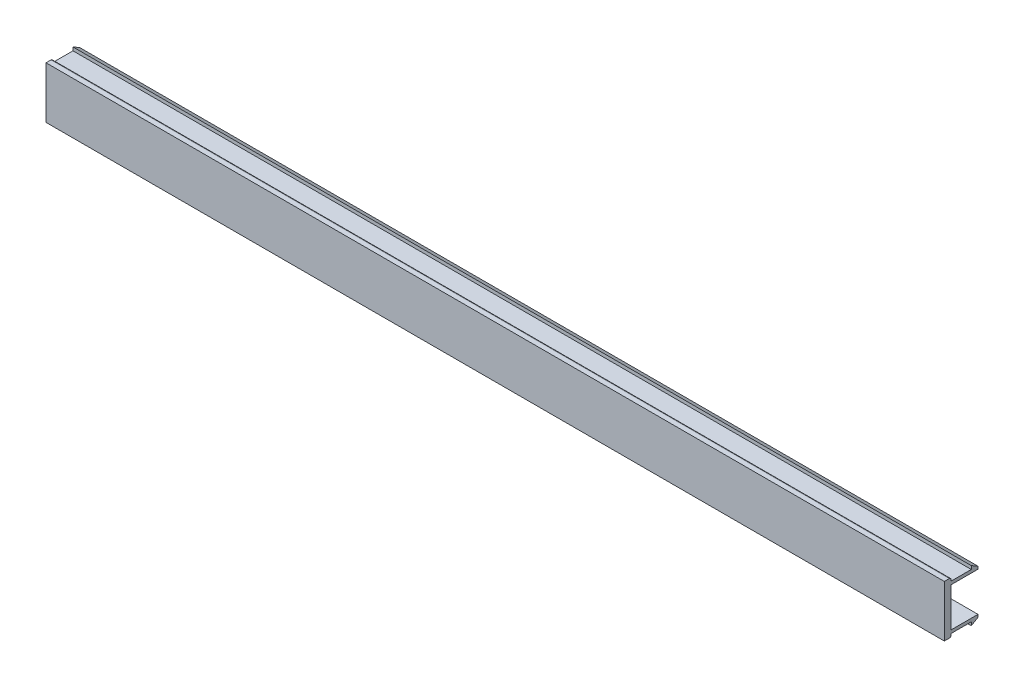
ISO-10303-21;
HEADER;
FILE_DESCRIPTION(('STEP AP214'),'2;1');
FILE_NAME('part.step','',(''),(''),'','','');
FILE_SCHEMA(('AUTOMOTIVE_DESIGN { 1 0 10303 214 1 1 1 1 }'));
ENDSEC;
DATA;
#1=APPLICATION_CONTEXT('core data for automotive mechanical design processes');
#2=APPLICATION_PROTOCOL_DEFINITION('international standard','automotive_design',2000,#1);
#3=PRODUCT_CONTEXT('',#1,'mechanical');
#4=PRODUCT('Part','Part','',(#3));
#5=PRODUCT_RELATED_PRODUCT_CATEGORY('part','',(#4));
#6=PRODUCT_DEFINITION_FORMATION('','',#4);
#7=PRODUCT_DEFINITION_CONTEXT('part definition',#1,'design');
#8=PRODUCT_DEFINITION('design','',#6,#7);
#9=PRODUCT_DEFINITION_SHAPE('','',#8);
#10=(LENGTH_UNIT() NAMED_UNIT(*) SI_UNIT(.MILLI.,.METRE.));
#11=(NAMED_UNIT(*) PLANE_ANGLE_UNIT() SI_UNIT($,.RADIAN.));
#12=(NAMED_UNIT(*) SI_UNIT($,.STERADIAN.) SOLID_ANGLE_UNIT());
#13=UNCERTAINTY_MEASURE_WITH_UNIT(LENGTH_MEASURE(1.E-05),#10,'distance_accuracy_value','');
#14=(GEOMETRIC_REPRESENTATION_CONTEXT(3) GLOBAL_UNCERTAINTY_ASSIGNED_CONTEXT((#13)) GLOBAL_UNIT_ASSIGNED_CONTEXT((#10,
#11,#12)) REPRESENTATION_CONTEXT('',''));
#15=CARTESIAN_POINT('',(0.,0.,0.));
#16=DIRECTION('',(0.,0.,1.));
#17=DIRECTION('',(1.,0.,0.));
#18=AXIS2_PLACEMENT_3D('',#15,#16,#17);
#19=CARTESIAN_POINT('',(0.,-5.366987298,-6.75));
#20=DIRECTION('',(0.,-0.866025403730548,-0.500000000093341));
#21=DIRECTION('',(0.,0.500000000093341,-0.866025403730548));
#22=AXIS2_PLACEMENT_3D('',#19,#20,#21);
#23=PLANE('',#22);
#24=DIRECTION('',(0.,0.500000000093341,-0.866025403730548));
#25=VECTOR('',#24,1.);
#26=CARTESIAN_POINT('',(0.,-5.366987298,-6.75));
#27=LINE('',#26,#25);
#28=CARTESIAN_POINT('',(0.,-5.8,-6.));
#29=VERTEX_POINT('',#28);
#30=CARTESIAN_POINT('',(0.,-4.933974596,-7.5));
#31=VERTEX_POINT('',#30);
#32=EDGE_CURVE('E304',#29,#31,#27,.T.);
#33=ORIENTED_EDGE('',*,*,#32,.T.);
#34=DIRECTION('',(-1.,0.,0.));
#35=VECTOR('',#34,1.);
#36=CARTESIAN_POINT('',(0.,-4.933974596,-7.5));
#37=LINE('',#36,#35);
#38=CARTESIAN_POINT('',(200.,-4.933974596,-7.5));
#39=VERTEX_POINT('',#38);
#40=EDGE_CURVE('E257',#39,#31,#37,.T.);
#41=ORIENTED_EDGE('',*,*,#40,.F.);
#42=DIRECTION('',(0.,0.500000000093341,-0.866025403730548));
#43=VECTOR('',#42,1.);
#44=CARTESIAN_POINT('',(200.,-5.366987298,-6.75));
#45=LINE('',#44,#43);
#46=CARTESIAN_POINT('',(200.,-5.8,-6.));
#47=VERTEX_POINT('',#46);
#48=EDGE_CURVE('E306',#39,#47,#45,.F.);
#49=ORIENTED_EDGE('',*,*,#48,.T.);
#50=DIRECTION('',(1.,0.,0.));
#51=VECTOR('',#50,1.);
#52=CARTESIAN_POINT('',(0.,-5.8,-6.));
#53=LINE('',#52,#51);
#54=EDGE_CURVE('E263',#29,#47,#53,.T.);
#55=ORIENTED_EDGE('',*,*,#54,.F.);
#56=EDGE_LOOP('',(#33,#41,#49,#55));
#57=FACE_BOUND('',#56,.T.);
#58=ADVANCED_FACE('F15',(#57),#23,.T.);
#59=CARTESIAN_POINT('',(0.,5.366987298,-6.75));
#60=DIRECTION('',(0.,0.866025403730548,-0.500000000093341));
#61=DIRECTION('',(0.,0.500000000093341,0.866025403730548));
#62=AXIS2_PLACEMENT_3D('',#59,#60,#61);
#63=PLANE('',#62);
#64=DIRECTION('',(0.,0.500000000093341,0.866025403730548));
#65=VECTOR('',#64,1.);
#66=CARTESIAN_POINT('',(0.,5.366987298,-6.75));
#67=LINE('',#66,#65);
#68=CARTESIAN_POINT('',(0.,4.933974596,-7.5));
#69=VERTEX_POINT('',#68);
#70=CARTESIAN_POINT('',(0.,5.8,-6.));
#71=VERTEX_POINT('',#70);
#72=EDGE_CURVE('E280',#69,#71,#67,.T.);
#73=ORIENTED_EDGE('',*,*,#72,.T.);
#74=DIRECTION('',(1.,0.,0.));
#75=VECTOR('',#74,1.);
#76=CARTESIAN_POINT('',(0.,5.8,-6.));
#77=LINE('',#76,#75);
#78=CARTESIAN_POINT('',(200.,5.8,-6.));
#79=VERTEX_POINT('',#78);
#80=EDGE_CURVE('E274',#79,#71,#77,.F.);
#81=ORIENTED_EDGE('',*,*,#80,.F.);
#82=DIRECTION('',(0.,0.500000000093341,0.866025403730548));
#83=VECTOR('',#82,1.);
#84=CARTESIAN_POINT('',(200.,5.366987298,-6.75));
#85=LINE('',#84,#83);
#86=CARTESIAN_POINT('',(200.,4.933974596,-7.5));
#87=VERTEX_POINT('',#86);
#88=EDGE_CURVE('E301',#79,#87,#85,.F.);
#89=ORIENTED_EDGE('',*,*,#88,.T.);
#90=DIRECTION('',(-1.,0.,0.));
#91=VECTOR('',#90,1.);
#92=CARTESIAN_POINT('',(0.,4.933974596,-7.5));
#93=LINE('',#92,#91);
#94=EDGE_CURVE('E247',#69,#87,#93,.F.);
#95=ORIENTED_EDGE('',*,*,#94,.F.);
#96=EDGE_LOOP('',(#73,#81,#89,#95));
#97=FACE_BOUND('',#96,.T.);
#98=ADVANCED_FACE('F511',(#97),#63,.T.);
#99=CARTESIAN_POINT('',(0.,5.425,-6.));
#100=DIRECTION('',(0.,0.,1.));
#101=DIRECTION('',(1.,0.,0.));
#102=AXIS2_PLACEMENT_3D('',#99,#100,#101);
#103=PLANE('',#102);
#104=DIRECTION('',(0.,1.,0.));
#105=VECTOR('',#104,1.);
#106=CARTESIAN_POINT('',(0.,5.425,-6.));
#107=LINE('',#106,#105);
#108=CARTESIAN_POINT('',(0.,5.05,-6.));
#109=VERTEX_POINT('',#108);
#110=EDGE_CURVE('E271',#71,#109,#107,.F.);
#111=ORIENTED_EDGE('',*,*,#110,.T.);
#112=DIRECTION('',(1.,0.,0.));
#113=VECTOR('',#112,1.);
#114=CARTESIAN_POINT('',(0.,5.05,-6.));
#115=LINE('',#114,#113);
#116=CARTESIAN_POINT('',(200.,5.05,-6.));
#117=VERTEX_POINT('',#116);
#118=EDGE_CURVE('E230',#117,#109,#115,.F.);
#119=ORIENTED_EDGE('',*,*,#118,.F.);
#120=DIRECTION('',(0.,1.,0.));
#121=VECTOR('',#120,1.);
#122=CARTESIAN_POINT('',(200.,5.425,-6.));
#123=LINE('',#122,#121);
#124=EDGE_CURVE('E277',#117,#79,#123,.T.);
#125=ORIENTED_EDGE('',*,*,#124,.T.);
#126=ORIENTED_EDGE('',*,*,#80,.T.);
#127=EDGE_LOOP('',(#111,#119,#125,#126));
#128=FACE_BOUND('',#127,.T.);
#129=ADVANCED_FACE('F503',(#128),#103,.T.);
#130=CARTESIAN_POINT('',(0.,5.2,-1.5));
#131=DIRECTION('',(0.,0.,-1.));
#132=DIRECTION('',(-1.,0.,0.));
#133=AXIS2_PLACEMENT_3D('',#130,#131,#132);
#134=PLANE('',#133);
#135=DIRECTION('',(0.,1.,0.));
#136=VECTOR('',#135,1.);
#137=CARTESIAN_POINT('',(0.,5.2,-1.5));
#138=LINE('',#137,#136);
#139=CARTESIAN_POINT('',(0.,5.05,-1.5));
#140=VERTEX_POINT('',#139);
#141=CARTESIAN_POINT('',(0.,5.35,-1.5));
#142=VERTEX_POINT('',#141);
#143=EDGE_CURVE('E112',#140,#142,#138,.T.);
#144=ORIENTED_EDGE('',*,*,#143,.T.);
#145=DIRECTION('',(1.,0.,0.));
#146=VECTOR('',#145,1.);
#147=CARTESIAN_POINT('',(0.,5.35,-1.5));
#148=LINE('',#147,#146);
#149=CARTESIAN_POINT('',(200.,5.35,-1.5));
#150=VERTEX_POINT('',#149);
#151=EDGE_CURVE('E238',#150,#142,#148,.F.);
#152=ORIENTED_EDGE('',*,*,#151,.F.);
#153=DIRECTION('',(0.,1.,0.));
#154=VECTOR('',#153,1.);
#155=CARTESIAN_POINT('',(200.,5.2,-1.5));
#156=LINE('',#155,#154);
#157=CARTESIAN_POINT('',(200.,5.05,-1.5));
#158=VERTEX_POINT('',#157);
#159=EDGE_CURVE('E273',#150,#158,#156,.F.);
#160=ORIENTED_EDGE('',*,*,#159,.T.);
#161=DIRECTION('',(1.,0.,0.));
#162=VECTOR('',#161,1.);
#163=CARTESIAN_POINT('',(0.,5.05,-1.5));
#164=LINE('',#163,#162);
#165=EDGE_CURVE('E233',#140,#158,#164,.T.);
#166=ORIENTED_EDGE('',*,*,#165,.F.);
#167=EDGE_LOOP('',(#144,#152,#160,#166));
#168=FACE_BOUND('',#167,.T.);
#169=ADVANCED_FACE('F495',(#168),#134,.T.);
#170=CARTESIAN_POINT('',(0.,-5.425,-6.));
#171=DIRECTION('',(0.,0.,1.));
#172=DIRECTION('',(1.,0.,0.));
#173=AXIS2_PLACEMENT_3D('',#170,#171,#172);
#174=PLANE('',#173);
#175=DIRECTION('',(0.,1.,0.));
#176=VECTOR('',#175,1.);
#177=CARTESIAN_POINT('',(0.,-5.425,-6.));
#178=LINE('',#177,#176);
#179=CARTESIAN_POINT('',(0.,-5.05,-6.));
#180=VERTEX_POINT('',#179);
#181=EDGE_CURVE('E266',#180,#29,#178,.F.);
#182=ORIENTED_EDGE('',*,*,#181,.T.);
#183=ORIENTED_EDGE('',*,*,#54,.T.);
#184=DIRECTION('',(0.,1.,0.));
#185=VECTOR('',#184,1.);
#186=CARTESIAN_POINT('',(200.,-5.425,-6.));
#187=LINE('',#186,#185);
#188=CARTESIAN_POINT('',(200.,-5.05,-6.));
#189=VERTEX_POINT('',#188);
#190=EDGE_CURVE('E269',#47,#189,#187,.T.);
#191=ORIENTED_EDGE('',*,*,#190,.T.);
#192=DIRECTION('',(1.,0.,0.));
#193=VECTOR('',#192,1.);
#194=CARTESIAN_POINT('',(0.,-5.05,-6.));
#195=LINE('',#194,#193);
#196=EDGE_CURVE('E217',#180,#189,#195,.T.);
#197=ORIENTED_EDGE('',*,*,#196,.F.);
#198=EDGE_LOOP('',(#182,#183,#191,#197));
#199=FACE_BOUND('',#198,.T.);
#200=ADVANCED_FACE('F354',(#199),#174,.T.);
#201=CARTESIAN_POINT('',(0.,-4.641987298,-7.5));
#202=DIRECTION('',(0.,0.,-1.));
#203=DIRECTION('',(-1.,0.,0.));
#204=AXIS2_PLACEMENT_3D('',#201,#202,#203);
#205=PLANE('',#204);
#206=DIRECTION('',(0.,1.,0.));
#207=VECTOR('',#206,1.);
#208=CARTESIAN_POINT('',(0.,-4.641987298,-7.5));
#209=LINE('',#208,#207);
#210=CARTESIAN_POINT('',(0.,-4.35,-7.5));
#211=VERTEX_POINT('',#210);
#212=EDGE_CURVE('E255',#31,#211,#209,.T.);
#213=ORIENTED_EDGE('',*,*,#212,.T.);
#214=DIRECTION('',(1.,0.,0.));
#215=VECTOR('',#214,1.);
#216=CARTESIAN_POINT('',(0.,-4.35,-7.5));
#217=LINE('',#216,#215);
#218=CARTESIAN_POINT('',(200.,-4.35,-7.5));
#219=VERTEX_POINT('',#218);
#220=EDGE_CURVE('E214',#219,#211,#217,.F.);
#221=ORIENTED_EDGE('',*,*,#220,.F.);
#222=DIRECTION('',(0.,1.,0.));
#223=VECTOR('',#222,1.);
#224=CARTESIAN_POINT('',(200.,-4.641987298,-7.5));
#225=LINE('',#224,#223);
#226=EDGE_CURVE('E260',#219,#39,#225,.F.);
#227=ORIENTED_EDGE('',*,*,#226,.T.);
#228=ORIENTED_EDGE('',*,*,#40,.T.);
#229=EDGE_LOOP('',(#213,#221,#227,#228));
#230=FACE_BOUND('',#229,.T.);
#231=ADVANCED_FACE('F361',(#230),#205,.T.);
#232=CARTESIAN_POINT('',(0.,4.641987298,-7.5));
#233=DIRECTION('',(0.,0.,-1.));
#234=DIRECTION('',(-1.,0.,0.));
#235=AXIS2_PLACEMENT_3D('',#232,#233,#234);
#236=PLANE('',#235);
#237=DIRECTION('',(0.,1.,0.));
#238=VECTOR('',#237,1.);
#239=CARTESIAN_POINT('',(0.,4.641987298,-7.5));
#240=LINE('',#239,#238);
#241=CARTESIAN_POINT('',(0.,4.35,-7.5));
#242=VERTEX_POINT('',#241);
#243=EDGE_CURVE('E167',#242,#69,#240,.T.);
#244=ORIENTED_EDGE('',*,*,#243,.T.);
#245=ORIENTED_EDGE('',*,*,#94,.T.);
#246=DIRECTION('',(0.,1.,0.));
#247=VECTOR('',#246,1.);
#248=CARTESIAN_POINT('',(200.,4.641987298,-7.5));
#249=LINE('',#248,#247);
#250=CARTESIAN_POINT('',(200.,4.35,-7.5));
#251=VERTEX_POINT('',#250);
#252=EDGE_CURVE('E253',#87,#251,#249,.F.);
#253=ORIENTED_EDGE('',*,*,#252,.T.);
#254=DIRECTION('',(1.,0.,0.));
#255=VECTOR('',#254,1.);
#256=CARTESIAN_POINT('',(0.,4.35,-7.5));
#257=LINE('',#256,#255);
#258=EDGE_CURVE('E163',#242,#251,#257,.T.);
#259=ORIENTED_EDGE('',*,*,#258,.F.);
#260=EDGE_LOOP('',(#244,#245,#253,#259));
#261=FACE_BOUND('',#260,.T.);
#262=ADVANCED_FACE('F472',(#261),#236,.T.);
#263=CARTESIAN_POINT('',(0.,-5.2,-1.5));
#264=DIRECTION('',(0.,0.,-1.));
#265=DIRECTION('',(-1.,0.,0.));
#266=AXIS2_PLACEMENT_3D('',#263,#264,#265);
#267=PLANE('',#266);
#268=DIRECTION('',(0.,1.,0.));
#269=VECTOR('',#268,1.);
#270=CARTESIAN_POINT('',(0.,-5.2,-1.5));
#271=LINE('',#270,#269);
#272=CARTESIAN_POINT('',(0.,-5.35,-1.5));
#273=VERTEX_POINT('',#272);
#274=CARTESIAN_POINT('',(0.,-5.05,-1.5));
#275=VERTEX_POINT('',#274);
#276=EDGE_CURVE('E241',#273,#275,#271,.T.);
#277=ORIENTED_EDGE('',*,*,#276,.T.);
#278=DIRECTION('',(1.,0.,0.));
#279=VECTOR('',#278,1.);
#280=CARTESIAN_POINT('',(0.,-5.05,-1.5));
#281=LINE('',#280,#279);
#282=CARTESIAN_POINT('',(200.,-5.05,-1.5));
#283=VERTEX_POINT('',#282);
#284=EDGE_CURVE('E220',#283,#275,#281,.F.);
#285=ORIENTED_EDGE('',*,*,#284,.F.);
#286=DIRECTION('',(0.,1.,0.));
#287=VECTOR('',#286,1.);
#288=CARTESIAN_POINT('',(200.,-5.2,-1.5));
#289=LINE('',#288,#287);
#290=CARTESIAN_POINT('',(200.,-5.35,-1.5));
#291=VERTEX_POINT('',#290);
#292=EDGE_CURVE('E243',#283,#291,#289,.F.);
#293=ORIENTED_EDGE('',*,*,#292,.T.);
#294=DIRECTION('',(1.,0.,0.));
#295=VECTOR('',#294,1.);
#296=CARTESIAN_POINT('',(0.,-5.35,-1.5));
#297=LINE('',#296,#295);
#298=EDGE_CURVE('E191',#273,#291,#297,.T.);
#299=ORIENTED_EDGE('',*,*,#298,.F.);
#300=EDGE_LOOP('',(#277,#285,#293,#299));
#301=FACE_BOUND('',#300,.T.);
#302=ADVANCED_FACE('F348',(#301),#267,.T.);
#303=CARTESIAN_POINT('',(0.,5.35,-1.1));
#304=DIRECTION('',(1.,0.,0.));
#305=DIRECTION('',(0.,0.,-1.));
#306=AXIS2_PLACEMENT_3D('',#303,#304,#305);
#307=CYLINDRICAL_SURFACE('',#306,0.400000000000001);
#308=CARTESIAN_POINT('',(0.,5.35,-1.1));
#309=DIRECTION('',(1.,0.,0.));
#310=DIRECTION('',(0.,0.,-1.));
#311=AXIS2_PLACEMENT_3D('',#308,#309,#310);
#312=CIRCLE('',#311,0.400000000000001);
#313=CARTESIAN_POINT('',(0.,5.75,-1.1));
#314=VERTEX_POINT('',#313);
#315=EDGE_CURVE('E18',#142,#314,#312,.T.);
#316=ORIENTED_EDGE('',*,*,#315,.T.);
#317=DIRECTION('',(1.,0.,0.));
#318=VECTOR('',#317,1.);
#319=CARTESIAN_POINT('',(0.,5.75,-1.1));
#320=LINE('',#319,#318);
#321=CARTESIAN_POINT('',(200.,5.75,-1.1));
#322=VERTEX_POINT('',#321);
#323=EDGE_CURVE('E223',#322,#314,#320,.F.);
#324=ORIENTED_EDGE('',*,*,#323,.F.);
#325=CARTESIAN_POINT('',(200.,5.35,-1.1));
#326=DIRECTION('',(1.,0.,0.));
#327=DIRECTION('',(0.,0.,-1.));
#328=AXIS2_PLACEMENT_3D('',#325,#326,#327);
#329=CIRCLE('',#328,0.400000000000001);
#330=EDGE_CURVE('E319',#150,#322,#329,.T.);
#331=ORIENTED_EDGE('',*,*,#330,.F.);
#332=ORIENTED_EDGE('',*,*,#151,.T.);
#333=EDGE_LOOP('',(#316,#324,#331,#332));
#334=FACE_BOUND('',#333,.T.);
#335=ADVANCED_FACE('F332',(#334),#307,.T.);
#336=CARTESIAN_POINT('',(0.,5.05,-3.75));
#337=DIRECTION('',(0.,1.,0.));
#338=DIRECTION('',(0.,0.,1.));
#339=AXIS2_PLACEMENT_3D('',#336,#337,#338);
#340=PLANE('',#339);
#341=DIRECTION('',(0.,0.,-1.));
#342=VECTOR('',#341,1.);
#343=CARTESIAN_POINT('',(0.,5.05,-2.83618380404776));
#344=LINE('',#343,#342);
#345=EDGE_CURVE('E179',#109,#140,#344,.F.);
#346=ORIENTED_EDGE('',*,*,#345,.T.);
#347=ORIENTED_EDGE('',*,*,#165,.T.);
#348=DIRECTION('',(0.,0.,-1.));
#349=VECTOR('',#348,1.);
#350=CARTESIAN_POINT('',(200.,5.05,-2.83618380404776));
#351=LINE('',#350,#349);
#352=EDGE_CURVE('E188',#117,#158,#351,.F.);
#353=ORIENTED_EDGE('',*,*,#352,.F.);
#354=ORIENTED_EDGE('',*,*,#118,.T.);
#355=EDGE_LOOP('',(#346,#347,#353,#354));
#356=FACE_BOUND('',#355,.T.);
#357=ADVANCED_FACE('F371',(#356),#340,.T.);
#358=CARTESIAN_POINT('',(0.,-5.05,-3.75));
#359=DIRECTION('',(0.,-1.,0.));
#360=DIRECTION('',(0.,0.,-1.));
#361=AXIS2_PLACEMENT_3D('',#358,#359,#360);
#362=PLANE('',#361);
#363=DIRECTION('',(0.,0.,-1.));
#364=VECTOR('',#363,1.);
#365=CARTESIAN_POINT('',(0.,-5.05,-2.83618380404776));
#366=LINE('',#365,#364);
#367=EDGE_CURVE('E175',#275,#180,#366,.T.);
#368=ORIENTED_EDGE('',*,*,#367,.T.);
#369=ORIENTED_EDGE('',*,*,#196,.T.);
#370=DIRECTION('',(0.,0.,-1.));
#371=VECTOR('',#370,1.);
#372=CARTESIAN_POINT('',(200.,-5.05,-2.83618380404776));
#373=LINE('',#372,#371);
#374=EDGE_CURVE('E186',#283,#189,#373,.T.);
#375=ORIENTED_EDGE('',*,*,#374,.F.);
#376=ORIENTED_EDGE('',*,*,#284,.T.);
#377=EDGE_LOOP('',(#368,#369,#375,#376));
#378=FACE_BOUND('',#377,.T.);
#379=ADVANCED_FACE('F351',(#378),#362,.T.);
#380=CARTESIAN_POINT('',(0.,-4.35,-4.5));
#381=DIRECTION('',(0.,1.,0.));
#382=DIRECTION('',(0.,0.,1.));
#383=AXIS2_PLACEMENT_3D('',#380,#381,#382);
#384=PLANE('',#383);
#385=DIRECTION('',(0.,0.,-1.));
#386=VECTOR('',#385,1.);
#387=CARTESIAN_POINT('',(0.,-4.35,-2.83618380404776));
#388=LINE('',#387,#386);
#389=CARTESIAN_POINT('',(0.,-4.35,-1.5));
#390=VERTEX_POINT('',#389);
#391=EDGE_CURVE('E154',#211,#390,#388,.F.);
#392=ORIENTED_EDGE('',*,*,#391,.T.);
#393=DIRECTION('',(-1.,0.,0.));
#394=VECTOR('',#393,1.);
#395=CARTESIAN_POINT('',(0.,-4.35,-1.5));
#396=LINE('',#395,#394);
#397=CARTESIAN_POINT('',(200.,-4.35,-1.5));
#398=VERTEX_POINT('',#397);
#399=EDGE_CURVE('E119',#398,#390,#396,.T.);
#400=ORIENTED_EDGE('',*,*,#399,.F.);
#401=DIRECTION('',(0.,0.,-1.));
#402=VECTOR('',#401,1.);
#403=CARTESIAN_POINT('',(200.,-4.35,-2.83618380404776));
#404=LINE('',#403,#402);
#405=EDGE_CURVE('E182',#219,#398,#404,.F.);
#406=ORIENTED_EDGE('',*,*,#405,.F.);
#407=ORIENTED_EDGE('',*,*,#220,.T.);
#408=EDGE_LOOP('',(#392,#400,#406,#407));
#409=FACE_BOUND('',#408,.T.);
#410=ADVANCED_FACE('F362',(#409),#384,.T.);
#411=CARTESIAN_POINT('',(0.,0.,-1.5));
#412=DIRECTION('',(0.,0.,-1.));
#413=DIRECTION('',(-1.,0.,0.));
#414=AXIS2_PLACEMENT_3D('',#411,#412,#413);
#415=PLANE('',#414);
#416=DIRECTION('',(0.,1.,0.));
#417=VECTOR('',#416,1.);
#418=CARTESIAN_POINT('',(0.,0.,-1.5));
#419=LINE('',#418,#417);
#420=CARTESIAN_POINT('',(0.,4.35,-1.5));
#421=VERTEX_POINT('',#420);
#422=EDGE_CURVE('E146',#390,#421,#419,.T.);
#423=ORIENTED_EDGE('',*,*,#422,.T.);
#424=DIRECTION('',(1.,0.,0.));
#425=VECTOR('',#424,1.);
#426=CARTESIAN_POINT('',(0.,4.35,-1.5));
#427=LINE('',#426,#425);
#428=CARTESIAN_POINT('',(200.,4.35,-1.5));
#429=VERTEX_POINT('',#428);
#430=EDGE_CURVE('E149',#429,#421,#427,.F.);
#431=ORIENTED_EDGE('',*,*,#430,.F.);
#432=DIRECTION('',(0.,1.,0.));
#433=VECTOR('',#432,1.);
#434=CARTESIAN_POINT('',(200.,0.,-1.5));
#435=LINE('',#434,#433);
#436=EDGE_CURVE('E189',#398,#429,#435,.T.);
#437=ORIENTED_EDGE('',*,*,#436,.F.);
#438=ORIENTED_EDGE('',*,*,#399,.T.);
#439=EDGE_LOOP('',(#423,#431,#437,#438));
#440=FACE_BOUND('',#439,.T.);
#441=ADVANCED_FACE('F148',(#440),#415,.T.);
#442=CARTESIAN_POINT('',(0.,4.35,-4.5));
#443=DIRECTION('',(0.,-1.,0.));
#444=DIRECTION('',(0.,0.,-1.));
#445=AXIS2_PLACEMENT_3D('',#442,#443,#444);
#446=PLANE('',#445);
#447=DIRECTION('',(0.,0.,-1.));
#448=VECTOR('',#447,1.);
#449=CARTESIAN_POINT('',(0.,4.35,-2.83618380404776));
#450=LINE('',#449,#448);
#451=EDGE_CURVE('E153',#421,#242,#450,.T.);
#452=ORIENTED_EDGE('',*,*,#451,.T.);
#453=ORIENTED_EDGE('',*,*,#258,.T.);
#454=DIRECTION('',(0.,0.,-1.));
#455=VECTOR('',#454,1.);
#456=CARTESIAN_POINT('',(200.,4.35,-2.83618380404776));
#457=LINE('',#456,#455);
#458=EDGE_CURVE('E161',#429,#251,#457,.T.);
#459=ORIENTED_EDGE('',*,*,#458,.F.);
#460=ORIENTED_EDGE('',*,*,#430,.T.);
#461=EDGE_LOOP('',(#452,#453,#459,#460));
#462=FACE_BOUND('',#461,.T.);
#463=ADVANCED_FACE('F158',(#462),#446,.T.);
#464=CARTESIAN_POINT('',(0.,-5.35,-1.1));
#465=DIRECTION('',(1.,0.,0.));
#466=DIRECTION('',(0.,0.,-1.));
#467=AXIS2_PLACEMENT_3D('',#464,#465,#466);
#468=CYLINDRICAL_SURFACE('',#467,0.400000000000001);
#469=CARTESIAN_POINT('',(0.,-5.35,-1.1));
#470=DIRECTION('',(1.,0.,0.));
#471=DIRECTION('',(0.,0.,-1.));
#472=AXIS2_PLACEMENT_3D('',#469,#470,#471);
#473=CIRCLE('',#472,0.400000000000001);
#474=CARTESIAN_POINT('',(0.,-5.75,-1.1));
#475=VERTEX_POINT('',#474);
#476=EDGE_CURVE('E178',#475,#273,#473,.T.);
#477=ORIENTED_EDGE('',*,*,#476,.T.);
#478=ORIENTED_EDGE('',*,*,#298,.T.);
#479=CARTESIAN_POINT('',(200.,-5.35,-1.1));
#480=DIRECTION('',(1.,0.,0.));
#481=DIRECTION('',(0.,0.,-1.));
#482=AXIS2_PLACEMENT_3D('',#479,#480,#481);
#483=CIRCLE('',#482,0.400000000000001);
#484=CARTESIAN_POINT('',(200.,-5.75,-1.1));
#485=VERTEX_POINT('',#484);
#486=EDGE_CURVE('E297',#485,#291,#483,.T.);
#487=ORIENTED_EDGE('',*,*,#486,.F.);
#488=DIRECTION('',(1.,0.,0.));
#489=VECTOR('',#488,1.);
#490=CARTESIAN_POINT('',(0.,-5.75,-1.1));
#491=LINE('',#490,#489);
#492=EDGE_CURVE('E192',#475,#485,#491,.T.);
#493=ORIENTED_EDGE('',*,*,#492,.F.);
#494=EDGE_LOOP('',(#477,#478,#487,#493));
#495=FACE_BOUND('',#494,.T.);
#496=ADVANCED_FACE('F343',(#495),#468,.T.);
#497=CARTESIAN_POINT('',(200.,0.,-2.83618380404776));
#498=DIRECTION('',(1.,0.,0.));
#499=DIRECTION('',(0.,0.,-1.));
#500=AXIS2_PLACEMENT_3D('',#497,#498,#499);
#501=PLANE('',#500);
#502=ORIENTED_EDGE('',*,*,#226,.F.);
#503=ORIENTED_EDGE('',*,*,#405,.T.);
#504=ORIENTED_EDGE('',*,*,#436,.T.);
#505=ORIENTED_EDGE('',*,*,#458,.T.);
#506=ORIENTED_EDGE('',*,*,#252,.F.);
#507=ORIENTED_EDGE('',*,*,#88,.F.);
#508=ORIENTED_EDGE('',*,*,#124,.F.);
#509=ORIENTED_EDGE('',*,*,#352,.T.);
#510=ORIENTED_EDGE('',*,*,#159,.F.);
#511=ORIENTED_EDGE('',*,*,#330,.T.);
#512=DIRECTION('',(0.,0.,1.));
#513=VECTOR('',#512,1.);
#514=CARTESIAN_POINT('',(200.,5.75,-0.55));
#515=LINE('',#514,#513);
#516=CARTESIAN_POINT('',(200.,5.75,0.));
#517=VERTEX_POINT('',#516);
#518=EDGE_CURVE('E185',#517,#322,#515,.F.);
#519=ORIENTED_EDGE('',*,*,#518,.F.);
#520=DIRECTION('',(0.,1.,0.));
#521=VECTOR('',#520,1.);
#522=CARTESIAN_POINT('',(200.,0.,0.));
#523=LINE('',#522,#521);
#524=CARTESIAN_POINT('',(200.,-5.75,0.));
#525=VERTEX_POINT('',#524);
#526=EDGE_CURVE('E195',#525,#517,#523,.T.);
#527=ORIENTED_EDGE('',*,*,#526,.F.);
#528=DIRECTION('',(0.,0.,-1.));
#529=VECTOR('',#528,1.);
#530=CARTESIAN_POINT('',(200.,-5.75,-0.55));
#531=LINE('',#530,#529);
#532=EDGE_CURVE('E169',#485,#525,#531,.F.);
#533=ORIENTED_EDGE('',*,*,#532,.F.);
#534=ORIENTED_EDGE('',*,*,#486,.T.);
#535=ORIENTED_EDGE('',*,*,#292,.F.);
#536=ORIENTED_EDGE('',*,*,#374,.T.);
#537=ORIENTED_EDGE('',*,*,#190,.F.);
#538=ORIENTED_EDGE('',*,*,#48,.F.);
#539=EDGE_LOOP('',(#502,#503,#504,#505,#506,#507,#508,#509,#510,#511,#519,#527,#533,#534,#535,
#536,#537,#538));
#540=FACE_BOUND('',#539,.T.);
#541=ADVANCED_FACE('F328',(#540),#501,.T.);
#542=CARTESIAN_POINT('',(0.,5.75,-0.55));
#543=DIRECTION('',(0.,1.,0.));
#544=DIRECTION('',(0.,0.,1.));
#545=AXIS2_PLACEMENT_3D('',#542,#543,#544);
#546=PLANE('',#545);
#547=DIRECTION('',(0.,0.,-1.));
#548=VECTOR('',#547,1.);
#549=CARTESIAN_POINT('',(0.,5.75,-2.83618380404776));
#550=LINE('',#549,#548);
#551=CARTESIAN_POINT('',(0.,5.75,0.));
#552=VERTEX_POINT('',#551);
#553=EDGE_CURVE('E176',#314,#552,#550,.F.);
#554=ORIENTED_EDGE('',*,*,#553,.T.);
#555=DIRECTION('',(1.,0.,0.));
#556=VECTOR('',#555,1.);
#557=CARTESIAN_POINT('',(0.,5.75,0.));
#558=LINE('',#557,#556);
#559=EDGE_CURVE('E203',#517,#552,#558,.F.);
#560=ORIENTED_EDGE('',*,*,#559,.F.);
#561=ORIENTED_EDGE('',*,*,#518,.T.);
#562=ORIENTED_EDGE('',*,*,#323,.T.);
#563=EDGE_LOOP('',(#554,#560,#561,#562));
#564=FACE_BOUND('',#563,.T.);
#565=ADVANCED_FACE('F335',(#564),#546,.T.);
#566=CARTESIAN_POINT('',(0.,0.,-2.83618380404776));
#567=DIRECTION('',(1.,0.,0.));
#568=DIRECTION('',(0.,0.,-1.));
#569=AXIS2_PLACEMENT_3D('',#566,#567,#568);
#570=PLANE('',#569);
#571=ORIENTED_EDGE('',*,*,#422,.F.);
#572=ORIENTED_EDGE('',*,*,#391,.F.);
#573=ORIENTED_EDGE('',*,*,#212,.F.);
#574=ORIENTED_EDGE('',*,*,#32,.F.);
#575=ORIENTED_EDGE('',*,*,#181,.F.);
#576=ORIENTED_EDGE('',*,*,#367,.F.);
#577=ORIENTED_EDGE('',*,*,#276,.F.);
#578=ORIENTED_EDGE('',*,*,#476,.F.);
#579=DIRECTION('',(0.,0.,-1.));
#580=VECTOR('',#579,1.);
#581=CARTESIAN_POINT('',(0.,-5.75,-0.55));
#582=LINE('',#581,#580);
#583=CARTESIAN_POINT('',(0.,-5.75,0.));
#584=VERTEX_POINT('',#583);
#585=EDGE_CURVE('E33',#584,#475,#582,.T.);
#586=ORIENTED_EDGE('',*,*,#585,.F.);
#587=DIRECTION('',(0.,1.,0.));
#588=VECTOR('',#587,1.);
#589=CARTESIAN_POINT('',(0.,0.,0.));
#590=LINE('',#589,#588);
#591=EDGE_CURVE('E24',#552,#584,#590,.F.);
#592=ORIENTED_EDGE('',*,*,#591,.F.);
#593=ORIENTED_EDGE('',*,*,#553,.F.);
#594=ORIENTED_EDGE('',*,*,#315,.F.);
#595=ORIENTED_EDGE('',*,*,#143,.F.);
#596=ORIENTED_EDGE('',*,*,#345,.F.);
#597=ORIENTED_EDGE('',*,*,#110,.F.);
#598=ORIENTED_EDGE('',*,*,#72,.F.);
#599=ORIENTED_EDGE('',*,*,#243,.F.);
#600=ORIENTED_EDGE('',*,*,#451,.F.);
#601=EDGE_LOOP('',(#571,#572,#573,#574,#575,#576,#577,#578,#586,#592,#593,#594,#595,#596,#597,
#598,#599,#600));
#602=FACE_BOUND('',#601,.T.);
#603=ADVANCED_FACE('F165',(#602),#570,.F.);
#604=CARTESIAN_POINT('',(0.,-5.75,-0.55));
#605=DIRECTION('',(0.,-1.,0.));
#606=DIRECTION('',(0.,0.,-1.));
#607=AXIS2_PLACEMENT_3D('',#604,#605,#606);
#608=PLANE('',#607);
#609=ORIENTED_EDGE('',*,*,#585,.T.);
#610=ORIENTED_EDGE('',*,*,#492,.T.);
#611=ORIENTED_EDGE('',*,*,#532,.T.);
#612=DIRECTION('',(1.,0.,0.));
#613=VECTOR('',#612,1.);
#614=CARTESIAN_POINT('',(0.,-5.75,0.));
#615=LINE('',#614,#613);
#616=EDGE_CURVE('E10',#584,#525,#615,.T.);
#617=ORIENTED_EDGE('',*,*,#616,.F.);
#618=EDGE_LOOP('',(#609,#610,#611,#617));
#619=FACE_BOUND('',#618,.T.);
#620=ADVANCED_FACE('F340',(#619),#608,.T.);
#621=CARTESIAN_POINT('',(0.,0.,0.));
#622=DIRECTION('',(0.,0.,1.));
#623=DIRECTION('',(1.,0.,0.));
#624=AXIS2_PLACEMENT_3D('',#621,#622,#623);
#625=PLANE('',#624);
#626=ORIENTED_EDGE('',*,*,#591,.T.);
#627=ORIENTED_EDGE('',*,*,#616,.T.);
#628=ORIENTED_EDGE('',*,*,#526,.T.);
#629=ORIENTED_EDGE('',*,*,#559,.T.);
#630=EDGE_LOOP('',(#626,#627,#628,#629));
#631=FACE_BOUND('',#630,.T.);
#632=ADVANCED_FACE('F337',(#631),#625,.T.);
#633=CLOSED_SHELL('',(#58,#98,#129,#169,#200,#231,#262,#302,#335,#357,#379,#410,#441,#463,#496,
#541,#565,#603,#620,#632));
#634=MANIFOLD_SOLID_BREP('B1',#633);
#635=ADVANCED_BREP_SHAPE_REPRESENTATION('',(#18,#634),#14);
#636=SHAPE_DEFINITION_REPRESENTATION(#9,#635);
ENDSEC;
END-ISO-10303-21;
